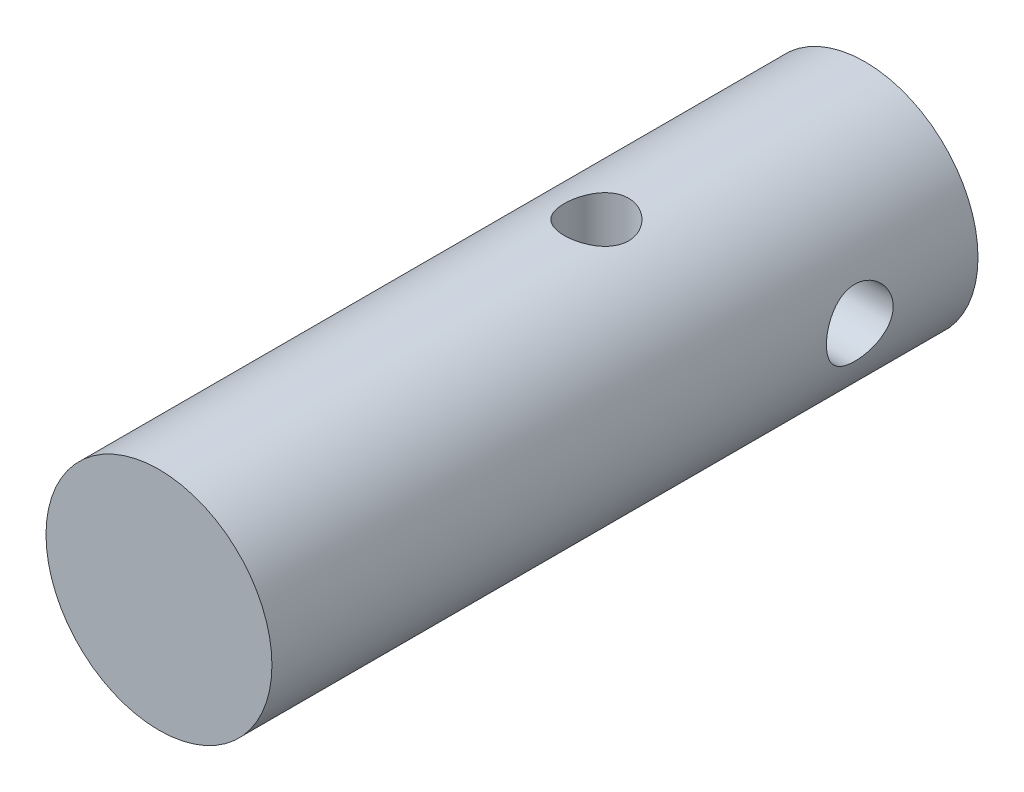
ISO-10303-21;
HEADER;
FILE_DESCRIPTION(('STEP AP214'),'2;1');
FILE_NAME('part.step','',(''),(''),'','','');
FILE_SCHEMA(('AUTOMOTIVE_DESIGN { 1 0 10303 214 1 1 1 1 }'));
ENDSEC;
DATA;
#1=APPLICATION_CONTEXT('core data for automotive mechanical design processes');
#2=APPLICATION_PROTOCOL_DEFINITION('international standard','automotive_design',2000,#1);
#3=PRODUCT_CONTEXT('',#1,'mechanical');
#4=PRODUCT('Part','Part','',(#3));
#5=PRODUCT_RELATED_PRODUCT_CATEGORY('part','',(#4));
#6=PRODUCT_DEFINITION_FORMATION('','',#4);
#7=PRODUCT_DEFINITION_CONTEXT('part definition',#1,'design');
#8=PRODUCT_DEFINITION('design','',#6,#7);
#9=PRODUCT_DEFINITION_SHAPE('','',#8);
#10=(LENGTH_UNIT() NAMED_UNIT(*) SI_UNIT(.MILLI.,.METRE.));
#11=(NAMED_UNIT(*) PLANE_ANGLE_UNIT() SI_UNIT($,.RADIAN.));
#12=(NAMED_UNIT(*) SI_UNIT($,.STERADIAN.) SOLID_ANGLE_UNIT());
#13=UNCERTAINTY_MEASURE_WITH_UNIT(LENGTH_MEASURE(1.E-05),#10,'distance_accuracy_value','');
#14=(GEOMETRIC_REPRESENTATION_CONTEXT(3) GLOBAL_UNCERTAINTY_ASSIGNED_CONTEXT((#13)) GLOBAL_UNIT_ASSIGNED_CONTEXT((#10,
#11,#12)) REPRESENTATION_CONTEXT('',''));
#15=CARTESIAN_POINT('',(0.,0.,0.));
#16=DIRECTION('',(0.,0.,1.));
#17=DIRECTION('',(1.,0.,0.));
#18=AXIS2_PLACEMENT_3D('',#15,#16,#17);
#19=CARTESIAN_POINT('',(0.,0.,-6.35));
#20=DIRECTION('',(0.,0.,1.));
#21=DIRECTION('',(1.,0.,0.));
#22=AXIS2_PLACEMENT_3D('',#19,#20,#21);
#23=CYLINDRICAL_SURFACE('',#22,5.08);
#24=CARTESIAN_POINT('',(5.08,0.,-2.53498163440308));
#25=CARTESIAN_POINT('',(5.07999919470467,0.0823481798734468,-2.5349804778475));
#26=CARTESIAN_POINT('',(5.07797844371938,0.164708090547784,-2.52817788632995));
#27=CARTESIAN_POINT('',(5.07011450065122,0.327033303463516,-2.50120938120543));
#28=CARTESIAN_POINT('',(5.06427006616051,0.406997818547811,-2.48103912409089));
#29=CARTESIAN_POINT('',(5.04939984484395,0.562167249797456,-2.42806469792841));
#30=CARTESIAN_POINT('',(5.04037866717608,0.637378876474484,-2.39527882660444));
#31=CARTESIAN_POINT('',(5.02009490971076,0.781237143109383,-2.31807782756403));
#32=CARTESIAN_POINT('',(5.00883205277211,0.849882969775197,-2.27366126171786));
#33=CARTESIAN_POINT('',(4.98491707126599,0.980576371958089,-2.17315344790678));
#34=CARTESIAN_POINT('',(4.97223715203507,1.04241484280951,-2.11679692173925));
#35=CARTESIAN_POINT('',(4.94708477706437,1.15591462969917,-1.9945745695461));
#36=CARTESIAN_POINT('',(4.93461235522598,1.20757429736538,-1.92870720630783));
#37=CARTESIAN_POINT('',(4.91099458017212,1.30033826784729,-1.78757855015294));
#38=CARTESIAN_POINT('',(4.8998838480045,1.34118953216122,-1.71214459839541));
#39=CARTESIAN_POINT('',(4.88066188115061,1.40954223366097,-1.55509673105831));
#40=CARTESIAN_POINT('',(4.87254995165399,1.43704676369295,-1.47348425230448));
#41=CARTESIAN_POINT('',(4.86053330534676,1.47717532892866,-1.30873956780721));
#42=CARTESIAN_POINT('',(4.85652010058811,1.49018395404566,-1.22570916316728));
#43=CARTESIAN_POINT('',(4.85283234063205,1.5021521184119,-1.05855490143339));
#44=CARTESIAN_POINT('',(4.8531567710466,1.5011149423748,-0.974431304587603));
#45=CARTESIAN_POINT('',(4.85801133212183,1.48532350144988,-0.810586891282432));
#46=CARTESIAN_POINT('',(4.86239449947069,1.47104853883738,-0.730814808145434));
#47=CARTESIAN_POINT('',(4.87463526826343,1.42996013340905,-0.57485225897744));
#48=CARTESIAN_POINT('',(4.88249320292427,1.4031454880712,-0.498662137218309));
#49=CARTESIAN_POINT('',(4.90091713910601,1.33738039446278,-0.350842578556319));
#50=CARTESIAN_POINT('',(4.9115179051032,1.29827265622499,-0.279287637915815));
#51=CARTESIAN_POINT('',(4.93421606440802,1.20914087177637,-0.143594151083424));
#52=CARTESIAN_POINT('',(4.94631381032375,1.15911425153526,-0.0794573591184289));
#53=CARTESIAN_POINT('',(4.97124119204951,1.04717388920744,0.0423008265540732));
#54=CARTESIAN_POINT('',(4.98408065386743,0.984861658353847,0.0995544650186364));
#55=CARTESIAN_POINT('',(5.00861106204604,0.851360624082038,0.202883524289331));
#56=CARTESIAN_POINT('',(5.02030194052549,0.780171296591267,0.248958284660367));
#57=CARTESIAN_POINT('',(5.04131910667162,0.630283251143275,0.3288356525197));
#58=CARTESIAN_POINT('',(5.05062999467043,0.55153994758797,0.362558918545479));
#59=CARTESIAN_POINT('',(5.0657271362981,0.389161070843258,0.416176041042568));
#60=CARTESIAN_POINT('',(5.07151434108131,0.305526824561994,0.436073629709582));
#61=CARTESIAN_POINT('',(5.07876258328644,0.138868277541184,0.460867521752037));
#62=CARTESIAN_POINT('',(5.08036736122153,0.0559242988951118,0.466262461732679));
#63=CARTESIAN_POINT('',(5.07949038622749,-0.109688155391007,0.463292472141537));
#64=CARTESIAN_POINT('',(5.07700916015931,-0.192356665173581,0.454929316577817));
#65=CARTESIAN_POINT('',(5.06833290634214,-0.353204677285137,0.425084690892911));
#66=CARTESIAN_POINT('',(5.06221986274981,-0.431442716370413,0.403892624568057));
#67=CARTESIAN_POINT('',(5.04698507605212,-0.583237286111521,0.349338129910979));
#68=CARTESIAN_POINT('',(5.03786297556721,-0.656793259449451,0.315974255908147));
#69=CARTESIAN_POINT('',(5.0173003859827,-0.79898576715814,0.237173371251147));
#70=CARTESIAN_POINT('',(5.0058120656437,-0.867473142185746,0.191480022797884));
#71=CARTESIAN_POINT('',(4.98183765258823,-0.995978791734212,0.0896302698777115));
#72=CARTESIAN_POINT('',(4.96935131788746,-1.05599500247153,0.0334713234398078));
#73=CARTESIAN_POINT('',(4.9442397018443,-1.16803678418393,-0.0900566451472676));
#74=CARTESIAN_POINT('',(4.93162492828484,-1.21970791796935,-0.157749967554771));
#75=CARTESIAN_POINT('',(4.90815255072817,-1.31097957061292,-0.301120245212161));
#76=CARTESIAN_POINT('',(4.89729489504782,-1.3505804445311,-0.376796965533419));
#77=CARTESIAN_POINT('',(4.87869198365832,-1.41630959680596,-0.533718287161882));
#78=CARTESIAN_POINT('',(4.87093152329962,-1.44250387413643,-0.61493333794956));
#79=CARTESIAN_POINT('',(4.859436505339,-1.48077134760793,-0.780891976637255));
#80=CARTESIAN_POINT('',(4.85570062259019,-1.49284919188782,-0.86563439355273));
#81=CARTESIAN_POINT('',(4.85280545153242,-1.50223177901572,-1.03256845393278));
#82=CARTESIAN_POINT('',(4.85346756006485,-1.50011301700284,-1.11472502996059));
#83=CARTESIAN_POINT('',(4.85886601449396,-1.4825328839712,-1.27745467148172));
#84=CARTESIAN_POINT('',(4.86360220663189,-1.46707201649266,-1.3580277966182));
#85=CARTESIAN_POINT('',(4.87649727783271,-1.42361341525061,-1.51439330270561));
#86=CARTESIAN_POINT('',(4.88461564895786,-1.39576380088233,-1.59023043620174));
#87=CARTESIAN_POINT('',(4.90335403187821,-1.32843324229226,-1.73621620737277));
#88=CARTESIAN_POINT('',(4.91397451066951,-1.28895012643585,-1.80636377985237));
#89=CARTESIAN_POINT('',(4.93698996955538,-1.19783515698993,-1.94166593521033));
#90=CARTESIAN_POINT('',(4.94943447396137,-1.14582256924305,-2.00655570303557));
#91=CARTESIAN_POINT('',(4.97445033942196,-1.03181610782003,-2.12687304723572));
#92=CARTESIAN_POINT('',(4.98702173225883,-0.969819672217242,-2.1822981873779));
#93=CARTESIAN_POINT('',(5.01129699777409,-0.835512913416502,-2.28365747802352));
#94=CARTESIAN_POINT('',(5.02296670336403,-0.762962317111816,-2.32928226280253));
#95=CARTESIAN_POINT('',(5.04371943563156,-0.61087544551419,-2.40762116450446));
#96=CARTESIAN_POINT('',(5.05280374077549,-0.531342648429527,-2.44034166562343));
#97=CARTESIAN_POINT('',(5.06651132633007,-0.377035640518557,-2.4888078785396));
#98=CARTESIAN_POINT('',(5.07152853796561,-0.302772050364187,-2.50607715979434));
#99=CARTESIAN_POINT('',(5.07827299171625,-0.152342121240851,-2.52916368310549));
#100=CARTESIAN_POINT('',(5.08000074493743,-0.0761760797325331,-2.53498270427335));
#101=CARTESIAN_POINT('',(5.08,0.,-2.53498163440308));
#102=B_SPLINE_CURVE_WITH_KNOTS('',3,(#24,#25,#26,#27,#28,#29,#30,#31,#32,#33,#34,#35,#36,#37,
#38,#39,#40,#41,#42,#43,#44,#45,#46,#47,#48,#49,#50,#51,#52,#53,#54,#55,#56,#57,#58,#59,#60,#61,
#62,#63,#64,#65,#66,#67,#68,#69,#70,#71,#72,#73,#74,#75,#76,#77,#78,#79,#80,#81,#82,#83,#84,#85,
#86,#87,#88,#89,#90,#91,#92,#93,#94,#95,#96,#97,#98,#99,#100,#101),.UNSPECIFIED.,.T.,.F.,(4,2,2,
2,2,2,2,2,2,2,2,2,2,2,2,2,2,2,2,2,2,2,2,2,2,2,2,2,2,2,2,2,2,2,2,2,2,2,4),(0.,0.246764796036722,
0.493609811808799,0.740098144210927,0.986616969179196,1.23932933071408,1.49208258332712,
1.75031388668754,2.00848532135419,2.25963083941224,2.51071762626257,2.75305400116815,
2.99541362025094,3.24100992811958,3.48666419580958,3.74223978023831,3.99783046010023,
4.25503530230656,4.51217068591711,4.76034475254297,5.00848682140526,5.25122951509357,
5.49400104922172,5.74227130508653,5.99060194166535,6.24764949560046,6.50468948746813,
6.76045162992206,7.01612953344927,7.26148963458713,7.50684047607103,7.74933361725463,
7.9918720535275,8.24300017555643,8.49419284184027,8.75242218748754,9.01052361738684,
9.23882855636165,9.46709801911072),.UNSPECIFIED.);
#103=CARTESIAN_POINT('',(5.08,0.,-2.53498163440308));
#104=VERTEX_POINT('',#103);
#105=EDGE_CURVE('E80',#104,#104,#102,.T.);
#106=ORIENTED_EDGE('',*,*,#105,.F.);
#107=EDGE_LOOP('',(#106));
#108=FACE_BOUND('',#107,.T.);
#109=CARTESIAN_POINT('',(-5.08,0.,-2.53498163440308));
#110=CARTESIAN_POINT('',(-5.07999919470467,-0.0823481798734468,-2.5349804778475));
#111=CARTESIAN_POINT('',(-5.07797844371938,-0.164708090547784,-2.52817788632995));
#112=CARTESIAN_POINT('',(-5.07011450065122,-0.327033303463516,-2.50120938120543));
#113=CARTESIAN_POINT('',(-5.06427006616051,-0.406997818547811,-2.48103912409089));
#114=CARTESIAN_POINT('',(-5.04939984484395,-0.562167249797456,-2.42806469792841));
#115=CARTESIAN_POINT('',(-5.04037866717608,-0.637378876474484,-2.39527882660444));
#116=CARTESIAN_POINT('',(-5.02009490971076,-0.781237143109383,-2.31807782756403));
#117=CARTESIAN_POINT('',(-5.00883205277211,-0.849882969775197,-2.27366126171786));
#118=CARTESIAN_POINT('',(-4.98491707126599,-0.980576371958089,-2.17315344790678));
#119=CARTESIAN_POINT('',(-4.97223715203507,-1.04241484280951,-2.11679692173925));
#120=CARTESIAN_POINT('',(-4.94708477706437,-1.15591462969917,-1.9945745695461));
#121=CARTESIAN_POINT('',(-4.93461235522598,-1.20757429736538,-1.92870720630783));
#122=CARTESIAN_POINT('',(-4.91099458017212,-1.30033826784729,-1.78757855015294));
#123=CARTESIAN_POINT('',(-4.8998838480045,-1.34118953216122,-1.71214459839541));
#124=CARTESIAN_POINT('',(-4.88066188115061,-1.40954223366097,-1.55509673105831));
#125=CARTESIAN_POINT('',(-4.87254995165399,-1.43704676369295,-1.47348425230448));
#126=CARTESIAN_POINT('',(-4.86053330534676,-1.47717532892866,-1.30873956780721));
#127=CARTESIAN_POINT('',(-4.85652010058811,-1.49018395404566,-1.22570916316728));
#128=CARTESIAN_POINT('',(-4.85283234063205,-1.5021521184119,-1.05855490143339));
#129=CARTESIAN_POINT('',(-4.8531567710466,-1.5011149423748,-0.974431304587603));
#130=CARTESIAN_POINT('',(-4.85801133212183,-1.48532350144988,-0.810586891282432));
#131=CARTESIAN_POINT('',(-4.86239449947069,-1.47104853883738,-0.730814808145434));
#132=CARTESIAN_POINT('',(-4.87463526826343,-1.42996013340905,-0.57485225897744));
#133=CARTESIAN_POINT('',(-4.88249320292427,-1.4031454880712,-0.498662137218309));
#134=CARTESIAN_POINT('',(-4.90091713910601,-1.33738039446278,-0.350842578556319));
#135=CARTESIAN_POINT('',(-4.9115179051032,-1.29827265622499,-0.279287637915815));
#136=CARTESIAN_POINT('',(-4.93421606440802,-1.20914087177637,-0.143594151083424));
#137=CARTESIAN_POINT('',(-4.94631381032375,-1.15911425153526,-0.0794573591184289));
#138=CARTESIAN_POINT('',(-4.97124119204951,-1.04717388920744,0.0423008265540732));
#139=CARTESIAN_POINT('',(-4.98408065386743,-0.984861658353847,0.0995544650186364));
#140=CARTESIAN_POINT('',(-5.00861106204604,-0.851360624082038,0.202883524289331));
#141=CARTESIAN_POINT('',(-5.02030194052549,-0.780171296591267,0.248958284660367));
#142=CARTESIAN_POINT('',(-5.04131910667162,-0.630283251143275,0.3288356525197));
#143=CARTESIAN_POINT('',(-5.05062999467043,-0.55153994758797,0.362558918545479));
#144=CARTESIAN_POINT('',(-5.0657271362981,-0.389161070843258,0.416176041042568));
#145=CARTESIAN_POINT('',(-5.07151434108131,-0.305526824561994,0.436073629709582));
#146=CARTESIAN_POINT('',(-5.07876258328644,-0.138868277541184,0.460867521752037));
#147=CARTESIAN_POINT('',(-5.08036736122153,-0.0559242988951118,0.466262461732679));
#148=CARTESIAN_POINT('',(-5.07949038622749,0.109688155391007,0.463292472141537));
#149=CARTESIAN_POINT('',(-5.07700916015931,0.192356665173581,0.454929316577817));
#150=CARTESIAN_POINT('',(-5.06833290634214,0.353204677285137,0.425084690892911));
#151=CARTESIAN_POINT('',(-5.06221986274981,0.431442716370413,0.403892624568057));
#152=CARTESIAN_POINT('',(-5.04698507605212,0.583237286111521,0.349338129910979));
#153=CARTESIAN_POINT('',(-5.03786297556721,0.656793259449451,0.315974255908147));
#154=CARTESIAN_POINT('',(-5.0173003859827,0.79898576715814,0.237173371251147));
#155=CARTESIAN_POINT('',(-5.0058120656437,0.867473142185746,0.191480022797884));
#156=CARTESIAN_POINT('',(-4.98183765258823,0.995978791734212,0.0896302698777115));
#157=CARTESIAN_POINT('',(-4.96935131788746,1.05599500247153,0.0334713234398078));
#158=CARTESIAN_POINT('',(-4.9442397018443,1.16803678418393,-0.0900566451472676));
#159=CARTESIAN_POINT('',(-4.93162492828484,1.21970791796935,-0.157749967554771));
#160=CARTESIAN_POINT('',(-4.90815255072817,1.31097957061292,-0.301120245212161));
#161=CARTESIAN_POINT('',(-4.89729489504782,1.3505804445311,-0.376796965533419));
#162=CARTESIAN_POINT('',(-4.87869198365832,1.41630959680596,-0.533718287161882));
#163=CARTESIAN_POINT('',(-4.87093152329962,1.44250387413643,-0.61493333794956));
#164=CARTESIAN_POINT('',(-4.859436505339,1.48077134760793,-0.780891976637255));
#165=CARTESIAN_POINT('',(-4.85570062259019,1.49284919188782,-0.86563439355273));
#166=CARTESIAN_POINT('',(-4.85280545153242,1.50223177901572,-1.03256845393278));
#167=CARTESIAN_POINT('',(-4.85346756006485,1.50011301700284,-1.11472502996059));
#168=CARTESIAN_POINT('',(-4.85886601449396,1.4825328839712,-1.27745467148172));
#169=CARTESIAN_POINT('',(-4.86360220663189,1.46707201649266,-1.3580277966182));
#170=CARTESIAN_POINT('',(-4.87649727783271,1.42361341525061,-1.51439330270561));
#171=CARTESIAN_POINT('',(-4.88461564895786,1.39576380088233,-1.59023043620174));
#172=CARTESIAN_POINT('',(-4.90335403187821,1.32843324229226,-1.73621620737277));
#173=CARTESIAN_POINT('',(-4.91397451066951,1.28895012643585,-1.80636377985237));
#174=CARTESIAN_POINT('',(-4.93698996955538,1.19783515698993,-1.94166593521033));
#175=CARTESIAN_POINT('',(-4.94943447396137,1.14582256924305,-2.00655570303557));
#176=CARTESIAN_POINT('',(-4.97445033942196,1.03181610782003,-2.12687304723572));
#177=CARTESIAN_POINT('',(-4.98702173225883,0.969819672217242,-2.1822981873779));
#178=CARTESIAN_POINT('',(-5.01129699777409,0.835512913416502,-2.28365747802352));
#179=CARTESIAN_POINT('',(-5.02296670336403,0.762962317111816,-2.32928226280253));
#180=CARTESIAN_POINT('',(-5.04371943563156,0.61087544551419,-2.40762116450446));
#181=CARTESIAN_POINT('',(-5.05280374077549,0.531342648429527,-2.44034166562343));
#182=CARTESIAN_POINT('',(-5.06651132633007,0.377035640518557,-2.4888078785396));
#183=CARTESIAN_POINT('',(-5.07152853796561,0.302772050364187,-2.50607715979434));
#184=CARTESIAN_POINT('',(-5.07827299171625,0.152342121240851,-2.52916368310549));
#185=CARTESIAN_POINT('',(-5.08000074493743,0.0761760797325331,-2.53498270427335));
#186=CARTESIAN_POINT('',(-5.08,0.,-2.53498163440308));
#187=B_SPLINE_CURVE_WITH_KNOTS('',3,(#109,#110,#111,#112,#113,#114,#115,#116,#117,#118,#119,
#120,#121,#122,#123,#124,#125,#126,#127,#128,#129,#130,#131,#132,#133,#134,#135,#136,#137,#138,
#139,#140,#141,#142,#143,#144,#145,#146,#147,#148,#149,#150,#151,#152,#153,#154,#155,#156,#157,
#158,#159,#160,#161,#162,#163,#164,#165,#166,#167,#168,#169,#170,#171,#172,#173,#174,#175,#176,
#177,#178,#179,#180,#181,#182,#183,#184,#185,#186),.UNSPECIFIED.,.T.,.F.,(4,2,2,2,2,2,2,2,2,2,2,
2,2,2,2,2,2,2,2,2,2,2,2,2,2,2,2,2,2,2,2,2,2,2,2,2,2,2,4),(0.,0.246764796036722,
0.493609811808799,0.740098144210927,0.986616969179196,1.23932933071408,1.49208258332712,
1.75031388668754,2.00848532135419,2.25963083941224,2.51071762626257,2.75305400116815,
2.99541362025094,3.24100992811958,3.48666419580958,3.74223978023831,3.99783046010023,
4.25503530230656,4.51217068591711,4.76034475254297,5.00848682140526,5.25122951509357,
5.49400104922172,5.74227130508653,5.99060194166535,6.24764949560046,6.50468948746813,
6.76045162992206,7.01612953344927,7.26148963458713,7.50684047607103,7.74933361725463,
7.9918720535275,8.24300017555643,8.49419284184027,8.75242218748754,9.01052361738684,
9.23882855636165,9.46709801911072),.UNSPECIFIED.);
#188=CARTESIAN_POINT('',(-5.08,0.,-2.53498163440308));
#189=VERTEX_POINT('',#188);
#190=EDGE_CURVE('E54',#189,#189,#187,.T.);
#191=ORIENTED_EDGE('',*,*,#190,.F.);
#192=EDGE_LOOP('',(#191));
#193=FACE_BOUND('',#192,.T.);
#194=CARTESIAN_POINT('',(0.,-5.08,7.18003673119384));
#195=CARTESIAN_POINT('',(-0.0797206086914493,-5.07999904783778,7.18003531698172));
#196=CARTESIAN_POINT('',(-0.159455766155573,-5.07810523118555,7.17344028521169));
#197=CARTESIAN_POINT('',(-0.316615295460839,-5.07073491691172,7.14728980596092));
#198=CARTESIAN_POINT('',(-0.394038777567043,-5.06525705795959,7.1277294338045));
#199=CARTESIAN_POINT('',(-0.54428473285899,-5.05132087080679,7.07634639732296));
#200=CARTESIAN_POINT('',(-0.617113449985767,-5.04286669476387,7.04454081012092));
#201=CARTESIAN_POINT('',(-0.756403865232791,-5.02386317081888,6.9696372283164));
#202=CARTESIAN_POINT('',(-0.822864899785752,-5.01331360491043,6.92653805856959));
#203=CARTESIAN_POINT('',(-0.949277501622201,-4.99094117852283,6.82907777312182));
#204=CARTESIAN_POINT('',(-1.00903824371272,-4.97909412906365,6.77447470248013));
#205=CARTESIAN_POINT('',(-1.11869094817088,-4.95561112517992,6.65607293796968));
#206=CARTESIAN_POINT('',(-1.16858143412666,-4.94397520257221,6.5922728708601));
#207=CARTESIAN_POINT('',(-1.25804806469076,-4.92197991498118,6.45571488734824));
#208=CARTESIAN_POINT('',(-1.29739735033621,-4.91165082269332,6.38280301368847));
#209=CARTESIAN_POINT('',(-1.36320052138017,-4.89379761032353,6.23105507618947));
#210=CARTESIAN_POINT('',(-1.38965717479,-4.886272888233,6.15222028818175));
#211=CARTESIAN_POINT('',(-1.42824736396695,-4.87513142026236,5.99299443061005));
#212=CARTESIAN_POINT('',(-1.44073014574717,-4.87141958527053,5.91269482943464));
#213=CARTESIAN_POINT('',(-1.45210809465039,-4.86804071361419,5.75106200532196));
#214=CARTESIAN_POINT('',(-1.45100620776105,-4.86837279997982,5.66972901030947));
#215=CARTESIAN_POINT('',(-1.43552173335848,-4.87295959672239,5.51112570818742));
#216=CARTESIAN_POINT('',(-1.42156980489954,-4.87708709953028,5.43380907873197));
#217=CARTESIAN_POINT('',(-1.38147436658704,-4.88859482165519,5.2826627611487));
#218=CARTESIAN_POINT('',(-1.35532975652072,-4.89597533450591,5.20883338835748));
#219=CARTESIAN_POINT('',(-1.29125891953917,-4.91326359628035,5.06567295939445));
#220=CARTESIAN_POINT('',(-1.25318797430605,-4.92320210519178,4.99641054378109));
#221=CARTESIAN_POINT('',(-1.16644588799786,-4.94447097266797,4.86510983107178));
#222=CARTESIAN_POINT('',(-1.11777239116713,-4.95580164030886,4.80307314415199));
#223=CARTESIAN_POINT('',(-1.00903951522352,-4.97910021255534,4.68553392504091));
#224=CARTESIAN_POINT('',(-0.948620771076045,-4.99107605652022,4.63036488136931));
#225=CARTESIAN_POINT('',(-0.819240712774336,-5.0139359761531,4.53086848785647));
#226=CARTESIAN_POINT('',(-0.750278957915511,-5.02481999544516,4.48654169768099));
#227=CARTESIAN_POINT('',(-0.605204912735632,-5.0443539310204,4.40981109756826));
#228=CARTESIAN_POINT('',(-0.529054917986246,-5.05299105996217,4.37747510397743));
#229=CARTESIAN_POINT('',(-0.372095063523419,-5.06696589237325,4.32616430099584));
#230=CARTESIAN_POINT('',(-0.291286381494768,-5.07230442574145,4.30718613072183));
#231=CARTESIAN_POINT('',(-0.130142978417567,-5.07895187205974,4.28367061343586));
#232=CARTESIAN_POINT('',(-0.0498794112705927,-5.08038703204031,4.27868067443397));
#233=CARTESIAN_POINT('',(0.11034047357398,-5.0794330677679,4.28202312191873));
#234=CARTESIAN_POINT('',(0.190296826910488,-5.07704440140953,4.29035391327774));
#235=CARTESIAN_POINT('',(0.34596621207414,-5.06879337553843,4.31973280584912));
#236=CARTESIAN_POINT('',(0.421732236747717,-5.06300182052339,4.34052185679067));
#237=CARTESIAN_POINT('',(0.568689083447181,-5.04860861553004,4.39392037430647));
#238=CARTESIAN_POINT('',(0.639879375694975,-5.0400066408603,4.42653120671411));
#239=CARTESIAN_POINT('',(0.777371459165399,-5.02065946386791,4.50344286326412));
#240=CARTESIAN_POINT('',(0.843534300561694,-5.00987194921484,4.54798116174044));
#241=CARTESIAN_POINT('',(0.967603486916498,-4.98739667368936,4.64719055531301));
#242=CARTESIAN_POINT('',(1.02550795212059,-4.97570870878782,4.70186395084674));
#243=CARTESIAN_POINT('',(1.13337192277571,-4.95227402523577,4.82191297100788));
#244=CARTESIAN_POINT('',(1.18301041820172,-4.94053784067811,4.8875796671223));
#245=CARTESIAN_POINT('',(1.27057891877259,-4.91874709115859,5.02656385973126));
#246=CARTESIAN_POINT('',(1.30850933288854,-4.90869246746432,5.09988108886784));
#247=CARTESIAN_POINT('',(1.37130819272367,-4.89152069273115,5.25177988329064));
#248=CARTESIAN_POINT('',(1.39624599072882,-4.88438798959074,5.3303309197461));
#249=CARTESIAN_POINT('',(1.4324806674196,-4.87388570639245,5.49075467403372));
#250=CARTESIAN_POINT('',(1.44378166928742,-4.87051498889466,5.57262638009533));
#251=CARTESIAN_POINT('',(1.45216038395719,-4.86802287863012,5.73405510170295));
#252=CARTESIAN_POINT('',(1.4497579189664,-4.86874617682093,5.81358311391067));
#253=CARTESIAN_POINT('',(1.43202296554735,-4.87399157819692,5.97104994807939));
#254=CARTESIAN_POINT('',(1.41669090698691,-4.87851355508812,6.04898882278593));
#255=CARTESIAN_POINT('',(1.37385277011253,-4.89074773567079,6.20030360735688));
#256=CARTESIAN_POINT('',(1.34647194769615,-4.89842706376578,6.27371782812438));
#257=CARTESIAN_POINT('',(1.2804104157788,-4.91610751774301,6.41496828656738));
#258=CARTESIAN_POINT('',(1.24172770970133,-4.92610905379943,6.48280353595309));
#259=CARTESIAN_POINT('',(1.15264882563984,-4.94772317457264,6.61341408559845));
#260=CARTESIAN_POINT('',(1.10190524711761,-4.95937834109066,6.67594541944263));
#261=CARTESIAN_POINT('',(0.990786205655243,-4.98276642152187,6.79177404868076));
#262=CARTESIAN_POINT('',(0.930408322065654,-4.99449935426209,6.84506901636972));
#263=CARTESIAN_POINT('',(0.799872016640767,-5.01708056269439,6.94226337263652));
#264=CARTESIAN_POINT('',(0.729502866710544,-5.02789852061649,6.98588746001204));
#265=CARTESIAN_POINT('',(0.582120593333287,-5.04708256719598,7.06062059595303));
#266=CARTESIAN_POINT('',(0.505111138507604,-5.05544999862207,7.09173650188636));
#267=CARTESIAN_POINT('',(0.357159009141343,-5.06789918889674,7.13720121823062));
#268=CARTESIAN_POINT('',(0.286761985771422,-5.07240153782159,7.15322390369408));
#269=CARTESIAN_POINT('',(0.14424712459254,-5.07845217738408,7.174641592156));
#270=CARTESIAN_POINT('',(0.0721295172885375,-5.0800008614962,7.180038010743));
#271=CARTESIAN_POINT('',(0.,-5.08,7.18003673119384));
#272=B_SPLINE_CURVE_WITH_KNOTS('',3,(#194,#195,#196,#197,#198,#199,#200,#201,#202,#203,#204,
#205,#206,#207,#208,#209,#210,#211,#212,#213,#214,#215,#216,#217,#218,#219,#220,#221,#222,#223,
#224,#225,#226,#227,#228,#229,#230,#231,#232,#233,#234,#235,#236,#237,#238,#239,#240,#241,#242,
#243,#244,#245,#246,#247,#248,#249,#250,#251,#252,#253,#254,#255,#256,#257,#258,#259,#260,#261,
#262,#263,#264,#265,#266,#267,#268,#269,#270,#271),.UNSPECIFIED.,.T.,.F.,(4,2,2,2,2,2,2,2,2,2,2,
2,2,2,2,2,2,2,2,2,2,2,2,2,2,2,2,2,2,2,2,2,2,2,2,2,2,2,4),(0.,0.238897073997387,
0.477884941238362,0.716540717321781,0.95522133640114,1.19953941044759,1.44389400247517,
1.69314791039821,1.94234828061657,2.18517079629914,2.42794065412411,2.66285917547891,
2.89779889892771,3.13570774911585,3.37366951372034,3.62058075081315,3.86750473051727,
4.11580467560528,4.36404212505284,4.60414960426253,4.84422833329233,5.07948025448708,
5.31475936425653,5.55512474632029,5.79554475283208,6.0438120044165,6.29207058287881,
6.53899006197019,6.78583486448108,7.02337977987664,7.26091679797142,7.49604072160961,
7.73120620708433,7.97420879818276,8.21727254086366,8.46655564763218,8.71570190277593,
8.93187971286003,9.14802872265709),.UNSPECIFIED.);
#273=CARTESIAN_POINT('',(0.,-5.08,7.18003673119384));
#274=VERTEX_POINT('',#273);
#275=EDGE_CURVE('E58',#274,#274,#272,.T.);
#276=ORIENTED_EDGE('',*,*,#275,.F.);
#277=EDGE_LOOP('',(#276));
#278=FACE_BOUND('',#277,.T.);
#279=CARTESIAN_POINT('',(0.,5.08,7.18003673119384));
#280=CARTESIAN_POINT('',(0.0797206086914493,5.07999904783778,7.18003531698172));
#281=CARTESIAN_POINT('',(0.159455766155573,5.07810523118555,7.17344028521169));
#282=CARTESIAN_POINT('',(0.316615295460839,5.07073491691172,7.14728980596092));
#283=CARTESIAN_POINT('',(0.394038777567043,5.06525705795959,7.1277294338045));
#284=CARTESIAN_POINT('',(0.54428473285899,5.05132087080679,7.07634639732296));
#285=CARTESIAN_POINT('',(0.617113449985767,5.04286669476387,7.04454081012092));
#286=CARTESIAN_POINT('',(0.756403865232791,5.02386317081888,6.9696372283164));
#287=CARTESIAN_POINT('',(0.822864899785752,5.01331360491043,6.92653805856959));
#288=CARTESIAN_POINT('',(0.949277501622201,4.99094117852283,6.82907777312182));
#289=CARTESIAN_POINT('',(1.00903824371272,4.97909412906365,6.77447470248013));
#290=CARTESIAN_POINT('',(1.11869094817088,4.95561112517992,6.65607293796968));
#291=CARTESIAN_POINT('',(1.16858143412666,4.94397520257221,6.5922728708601));
#292=CARTESIAN_POINT('',(1.25804806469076,4.92197991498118,6.45571488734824));
#293=CARTESIAN_POINT('',(1.29739735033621,4.91165082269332,6.38280301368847));
#294=CARTESIAN_POINT('',(1.36320052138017,4.89379761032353,6.23105507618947));
#295=CARTESIAN_POINT('',(1.38965717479,4.886272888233,6.15222028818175));
#296=CARTESIAN_POINT('',(1.42824736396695,4.87513142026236,5.99299443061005));
#297=CARTESIAN_POINT('',(1.44073014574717,4.87141958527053,5.91269482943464));
#298=CARTESIAN_POINT('',(1.45210809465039,4.86804071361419,5.75106200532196));
#299=CARTESIAN_POINT('',(1.45100620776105,4.86837279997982,5.66972901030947));
#300=CARTESIAN_POINT('',(1.43552173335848,4.87295959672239,5.51112570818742));
#301=CARTESIAN_POINT('',(1.42156980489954,4.87708709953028,5.43380907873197));
#302=CARTESIAN_POINT('',(1.38147436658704,4.88859482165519,5.2826627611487));
#303=CARTESIAN_POINT('',(1.35532975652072,4.89597533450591,5.20883338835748));
#304=CARTESIAN_POINT('',(1.29125891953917,4.91326359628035,5.06567295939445));
#305=CARTESIAN_POINT('',(1.25318797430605,4.92320210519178,4.99641054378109));
#306=CARTESIAN_POINT('',(1.16644588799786,4.94447097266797,4.86510983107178));
#307=CARTESIAN_POINT('',(1.11777239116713,4.95580164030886,4.80307314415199));
#308=CARTESIAN_POINT('',(1.00903951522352,4.97910021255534,4.68553392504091));
#309=CARTESIAN_POINT('',(0.948620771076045,4.99107605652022,4.63036488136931));
#310=CARTESIAN_POINT('',(0.819240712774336,5.0139359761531,4.53086848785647));
#311=CARTESIAN_POINT('',(0.750278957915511,5.02481999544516,4.48654169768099));
#312=CARTESIAN_POINT('',(0.605204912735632,5.0443539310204,4.40981109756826));
#313=CARTESIAN_POINT('',(0.529054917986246,5.05299105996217,4.37747510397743));
#314=CARTESIAN_POINT('',(0.372095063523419,5.06696589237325,4.32616430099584));
#315=CARTESIAN_POINT('',(0.291286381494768,5.07230442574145,4.30718613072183));
#316=CARTESIAN_POINT('',(0.130142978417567,5.07895187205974,4.28367061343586));
#317=CARTESIAN_POINT('',(0.0498794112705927,5.08038703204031,4.27868067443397));
#318=CARTESIAN_POINT('',(-0.11034047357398,5.0794330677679,4.28202312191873));
#319=CARTESIAN_POINT('',(-0.190296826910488,5.07704440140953,4.29035391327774));
#320=CARTESIAN_POINT('',(-0.34596621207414,5.06879337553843,4.31973280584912));
#321=CARTESIAN_POINT('',(-0.421732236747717,5.06300182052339,4.34052185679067));
#322=CARTESIAN_POINT('',(-0.568689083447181,5.04860861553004,4.39392037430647));
#323=CARTESIAN_POINT('',(-0.639879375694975,5.0400066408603,4.42653120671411));
#324=CARTESIAN_POINT('',(-0.777371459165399,5.02065946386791,4.50344286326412));
#325=CARTESIAN_POINT('',(-0.843534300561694,5.00987194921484,4.54798116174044));
#326=CARTESIAN_POINT('',(-0.967603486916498,4.98739667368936,4.64719055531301));
#327=CARTESIAN_POINT('',(-1.02550795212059,4.97570870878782,4.70186395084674));
#328=CARTESIAN_POINT('',(-1.13337192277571,4.95227402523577,4.82191297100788));
#329=CARTESIAN_POINT('',(-1.18301041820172,4.94053784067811,4.8875796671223));
#330=CARTESIAN_POINT('',(-1.27057891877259,4.91874709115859,5.02656385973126));
#331=CARTESIAN_POINT('',(-1.30850933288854,4.90869246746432,5.09988108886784));
#332=CARTESIAN_POINT('',(-1.37130819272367,4.89152069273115,5.25177988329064));
#333=CARTESIAN_POINT('',(-1.39624599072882,4.88438798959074,5.3303309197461));
#334=CARTESIAN_POINT('',(-1.4324806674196,4.87388570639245,5.49075467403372));
#335=CARTESIAN_POINT('',(-1.44378166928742,4.87051498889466,5.57262638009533));
#336=CARTESIAN_POINT('',(-1.45216038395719,4.86802287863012,5.73405510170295));
#337=CARTESIAN_POINT('',(-1.4497579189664,4.86874617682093,5.81358311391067));
#338=CARTESIAN_POINT('',(-1.43202296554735,4.87399157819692,5.97104994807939));
#339=CARTESIAN_POINT('',(-1.41669090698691,4.87851355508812,6.04898882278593));
#340=CARTESIAN_POINT('',(-1.37385277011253,4.89074773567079,6.20030360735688));
#341=CARTESIAN_POINT('',(-1.34647194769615,4.89842706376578,6.27371782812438));
#342=CARTESIAN_POINT('',(-1.2804104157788,4.91610751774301,6.41496828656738));
#343=CARTESIAN_POINT('',(-1.24172770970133,4.92610905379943,6.48280353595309));
#344=CARTESIAN_POINT('',(-1.15264882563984,4.94772317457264,6.61341408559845));
#345=CARTESIAN_POINT('',(-1.10190524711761,4.95937834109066,6.67594541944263));
#346=CARTESIAN_POINT('',(-0.990786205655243,4.98276642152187,6.79177404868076));
#347=CARTESIAN_POINT('',(-0.930408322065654,4.99449935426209,6.84506901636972));
#348=CARTESIAN_POINT('',(-0.799872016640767,5.01708056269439,6.94226337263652));
#349=CARTESIAN_POINT('',(-0.729502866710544,5.02789852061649,6.98588746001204));
#350=CARTESIAN_POINT('',(-0.582120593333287,5.04708256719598,7.06062059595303));
#351=CARTESIAN_POINT('',(-0.505111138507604,5.05544999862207,7.09173650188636));
#352=CARTESIAN_POINT('',(-0.357159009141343,5.06789918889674,7.13720121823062));
#353=CARTESIAN_POINT('',(-0.286761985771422,5.07240153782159,7.15322390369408));
#354=CARTESIAN_POINT('',(-0.14424712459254,5.07845217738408,7.174641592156));
#355=CARTESIAN_POINT('',(-0.0721295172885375,5.0800008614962,7.180038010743));
#356=CARTESIAN_POINT('',(0.,5.08,7.18003673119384));
#357=B_SPLINE_CURVE_WITH_KNOTS('',3,(#279,#280,#281,#282,#283,#284,#285,#286,#287,#288,#289,
#290,#291,#292,#293,#294,#295,#296,#297,#298,#299,#300,#301,#302,#303,#304,#305,#306,#307,#308,
#309,#310,#311,#312,#313,#314,#315,#316,#317,#318,#319,#320,#321,#322,#323,#324,#325,#326,#327,
#328,#329,#330,#331,#332,#333,#334,#335,#336,#337,#338,#339,#340,#341,#342,#343,#344,#345,#346,
#347,#348,#349,#350,#351,#352,#353,#354,#355,#356),.UNSPECIFIED.,.T.,.F.,(4,2,2,2,2,2,2,2,2,2,2,
2,2,2,2,2,2,2,2,2,2,2,2,2,2,2,2,2,2,2,2,2,2,2,2,2,2,2,4),(0.,0.238897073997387,
0.477884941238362,0.716540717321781,0.95522133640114,1.19953941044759,1.44389400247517,
1.69314791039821,1.94234828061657,2.18517079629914,2.42794065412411,2.66285917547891,
2.89779889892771,3.13570774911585,3.37366951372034,3.62058075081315,3.86750473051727,
4.11580467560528,4.36404212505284,4.60414960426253,4.84422833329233,5.07948025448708,
5.31475936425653,5.55512474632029,5.79554475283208,6.0438120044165,6.29207058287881,
6.53899006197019,6.78583486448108,7.02337977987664,7.26091679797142,7.49604072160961,
7.73120620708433,7.97420879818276,8.21727254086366,8.46655564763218,8.71570190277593,
8.93187971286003,9.14802872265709),.UNSPECIFIED.);
#358=CARTESIAN_POINT('',(0.,5.08,7.18003673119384));
#359=VERTEX_POINT('',#358);
#360=EDGE_CURVE('E69',#359,#359,#357,.T.);
#361=ORIENTED_EDGE('',*,*,#360,.F.);
#362=EDGE_LOOP('',(#361));
#363=FACE_BOUND('',#362,.T.);
#364=CARTESIAN_POINT('',(0.,0.,-6.35));
#365=DIRECTION('',(0.,0.,1.));
#366=DIRECTION('',(1.,0.,0.));
#367=AXIS2_PLACEMENT_3D('',#364,#365,#366);
#368=CIRCLE('',#367,5.08);
#369=CARTESIAN_POINT('',(5.08,0.,-6.35));
#370=VERTEX_POINT('',#369);
#371=EDGE_CURVE('E103',#370,#370,#368,.T.);
#372=ORIENTED_EDGE('',*,*,#371,.T.);
#373=EDGE_LOOP('',(#372));
#374=FACE_BOUND('',#373,.T.);
#375=CARTESIAN_POINT('',(0.,0.,25.4));
#376=DIRECTION('',(0.,0.,1.));
#377=DIRECTION('',(1.,0.,0.));
#378=AXIS2_PLACEMENT_3D('',#375,#376,#377);
#379=CIRCLE('',#378,5.08);
#380=CARTESIAN_POINT('',(5.08,0.,25.4));
#381=VERTEX_POINT('',#380);
#382=EDGE_CURVE('E102',#381,#381,#379,.T.);
#383=ORIENTED_EDGE('',*,*,#382,.F.);
#384=EDGE_LOOP('',(#383));
#385=FACE_BOUND('',#384,.T.);
#386=CARTESIAN_POINT('',(-5.08,0.,24.36));
#387=CARTESIAN_POINT('',(-5.07999919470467,-0.0823481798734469,24.3599988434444));
#388=CARTESIAN_POINT('',(-5.07797844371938,-0.164708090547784,24.3531962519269));
#389=CARTESIAN_POINT('',(-5.07011450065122,-0.327033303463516,24.3262277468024));
#390=CARTESIAN_POINT('',(-5.06427006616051,-0.406997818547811,24.3060574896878));
#391=CARTESIAN_POINT('',(-5.04939984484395,-0.562167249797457,24.2530830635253));
#392=CARTESIAN_POINT('',(-5.04037866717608,-0.637378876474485,24.2202971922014));
#393=CARTESIAN_POINT('',(-5.02009490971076,-0.781237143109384,24.143096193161));
#394=CARTESIAN_POINT('',(-5.00883205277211,-0.849882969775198,24.0986796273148));
#395=CARTESIAN_POINT('',(-4.98491707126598,-0.980576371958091,23.9981718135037));
#396=CARTESIAN_POINT('',(-4.97223715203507,-1.04241484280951,23.9418152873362));
#397=CARTESIAN_POINT('',(-4.94708477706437,-1.15591462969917,23.819592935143));
#398=CARTESIAN_POINT('',(-4.93461235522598,-1.20757429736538,23.7537255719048));
#399=CARTESIAN_POINT('',(-4.91099458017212,-1.30033826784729,23.6125969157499));
#400=CARTESIAN_POINT('',(-4.8998838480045,-1.34118953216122,23.5371629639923));
#401=CARTESIAN_POINT('',(-4.88066188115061,-1.40954223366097,23.3801150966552));
#402=CARTESIAN_POINT('',(-4.87254995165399,-1.43704676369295,23.2985026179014));
#403=CARTESIAN_POINT('',(-4.86053330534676,-1.47717532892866,23.1337579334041));
#404=CARTESIAN_POINT('',(-4.85652010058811,-1.49018395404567,23.0507275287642));
#405=CARTESIAN_POINT('',(-4.85283234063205,-1.50215211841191,22.8835732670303));
#406=CARTESIAN_POINT('',(-4.8531567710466,-1.5011149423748,22.7994496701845));
#407=CARTESIAN_POINT('',(-4.85801133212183,-1.48532350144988,22.6356052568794));
#408=CARTESIAN_POINT('',(-4.86239449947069,-1.47104853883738,22.5558331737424));
#409=CARTESIAN_POINT('',(-4.87463526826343,-1.42996013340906,22.3998706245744));
#410=CARTESIAN_POINT('',(-4.88249320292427,-1.40314548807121,22.3236805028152));
#411=CARTESIAN_POINT('',(-4.90091713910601,-1.33738039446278,22.1758609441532));
#412=CARTESIAN_POINT('',(-4.9115179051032,-1.298272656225,22.1043060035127));
#413=CARTESIAN_POINT('',(-4.93421606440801,-1.20914087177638,21.9686125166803));
#414=CARTESIAN_POINT('',(-4.94631381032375,-1.15911425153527,21.9044757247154));
#415=CARTESIAN_POINT('',(-4.97124119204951,-1.04717388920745,21.7827175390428));
#416=CARTESIAN_POINT('',(-4.98408065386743,-0.984861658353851,21.7254639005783));
#417=CARTESIAN_POINT('',(-5.00861106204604,-0.851360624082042,21.6221348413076));
#418=CARTESIAN_POINT('',(-5.02030194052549,-0.780171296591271,21.5760600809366));
#419=CARTESIAN_POINT('',(-5.04131910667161,-0.630283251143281,21.4961827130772));
#420=CARTESIAN_POINT('',(-5.05062999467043,-0.551539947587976,21.4624594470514));
#421=CARTESIAN_POINT('',(-5.0657271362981,-0.389161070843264,21.4088423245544));
#422=CARTESIAN_POINT('',(-5.07151434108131,-0.305526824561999,21.3889447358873));
#423=CARTESIAN_POINT('',(-5.07876258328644,-0.138868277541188,21.3641508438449));
#424=CARTESIAN_POINT('',(-5.08036736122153,-0.0559242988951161,21.3587559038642));
#425=CARTESIAN_POINT('',(-5.07949038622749,0.109688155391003,21.3617258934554));
#426=CARTESIAN_POINT('',(-5.07700916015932,0.192356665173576,21.3700890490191));
#427=CARTESIAN_POINT('',(-5.06833290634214,0.353204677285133,21.399933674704));
#428=CARTESIAN_POINT('',(-5.06221986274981,0.431442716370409,21.4211257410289));
#429=CARTESIAN_POINT('',(-5.04698507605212,0.583237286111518,21.4756802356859));
#430=CARTESIAN_POINT('',(-5.03786297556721,0.656793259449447,21.5090441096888));
#431=CARTESIAN_POINT('',(-5.0173003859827,0.798985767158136,21.5878449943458));
#432=CARTESIAN_POINT('',(-5.0058120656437,0.867473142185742,21.633538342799));
#433=CARTESIAN_POINT('',(-4.98183765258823,0.995978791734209,21.7353880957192));
#434=CARTESIAN_POINT('',(-4.96935131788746,1.05599500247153,21.7915470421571));
#435=CARTESIAN_POINT('',(-4.9442397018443,1.16803678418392,21.9150750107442));
#436=CARTESIAN_POINT('',(-4.93162492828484,1.21970791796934,21.9827683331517));
#437=CARTESIAN_POINT('',(-4.90815255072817,1.31097957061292,22.1261386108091));
#438=CARTESIAN_POINT('',(-4.89729489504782,1.3505804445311,22.2018153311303));
#439=CARTESIAN_POINT('',(-4.87869198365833,1.41630959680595,22.3587366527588));
#440=CARTESIAN_POINT('',(-4.87093152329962,1.44250387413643,22.4399517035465));
#441=CARTESIAN_POINT('',(-4.859436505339,1.48077134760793,22.6059103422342));
#442=CARTESIAN_POINT('',(-4.85570062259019,1.49284919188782,22.6906527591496));
#443=CARTESIAN_POINT('',(-4.85280545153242,1.50223177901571,22.8575868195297));
#444=CARTESIAN_POINT('',(-4.85346756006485,1.50011301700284,22.9397433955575));
#445=CARTESIAN_POINT('',(-4.85886601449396,1.4825328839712,23.1024730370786));
#446=CARTESIAN_POINT('',(-4.86360220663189,1.46707201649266,23.1830461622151));
#447=CARTESIAN_POINT('',(-4.87649727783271,1.42361341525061,23.3394116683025));
#448=CARTESIAN_POINT('',(-4.88461564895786,1.39576380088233,23.4152488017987));
#449=CARTESIAN_POINT('',(-4.90335403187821,1.32843324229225,23.5612345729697));
#450=CARTESIAN_POINT('',(-4.91397451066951,1.28895012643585,23.6313821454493));
#451=CARTESIAN_POINT('',(-4.93698996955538,1.19783515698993,23.7666843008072));
#452=CARTESIAN_POINT('',(-4.94943447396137,1.14582256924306,23.8315740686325));
#453=CARTESIAN_POINT('',(-4.97445033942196,1.03181610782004,23.9518914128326));
#454=CARTESIAN_POINT('',(-4.98702173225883,0.969819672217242,24.0073165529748));
#455=CARTESIAN_POINT('',(-5.01129699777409,0.835512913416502,24.1086758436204));
#456=CARTESIAN_POINT('',(-5.02296670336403,0.762962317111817,24.1543006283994));
#457=CARTESIAN_POINT('',(-5.04371943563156,0.610875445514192,24.2326395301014));
#458=CARTESIAN_POINT('',(-5.05280374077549,0.531342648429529,24.2653600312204));
#459=CARTESIAN_POINT('',(-5.06651132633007,0.377035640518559,24.3138262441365));
#460=CARTESIAN_POINT('',(-5.07152853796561,0.302772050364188,24.3310955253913));
#461=CARTESIAN_POINT('',(-5.07827299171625,0.152342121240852,24.3541820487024));
#462=CARTESIAN_POINT('',(-5.08000074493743,0.0761760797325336,24.3600010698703));
#463=CARTESIAN_POINT('',(-5.08,0.,24.36));
#464=B_SPLINE_CURVE_WITH_KNOTS('',3,(#386,#387,#388,#389,#390,#391,#392,#393,#394,#395,#396,
#397,#398,#399,#400,#401,#402,#403,#404,#405,#406,#407,#408,#409,#410,#411,#412,#413,#414,#415,
#416,#417,#418,#419,#420,#421,#422,#423,#424,#425,#426,#427,#428,#429,#430,#431,#432,#433,#434,
#435,#436,#437,#438,#439,#440,#441,#442,#443,#444,#445,#446,#447,#448,#449,#450,#451,#452,#453,
#454,#455,#456,#457,#458,#459,#460,#461,#462,#463),.UNSPECIFIED.,.T.,.F.,(4,2,2,2,2,2,2,2,2,2,2,
2,2,2,2,2,2,2,2,2,2,2,2,2,2,2,2,2,2,2,2,2,2,2,2,2,2,2,4),(0.,0.246764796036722,0.4936098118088,
0.740098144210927,0.986616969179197,1.23932933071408,1.49208258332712,1.75031388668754,
2.00848532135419,2.25963083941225,2.51071762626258,2.75305400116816,2.99541362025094,
3.24100992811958,3.48666419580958,3.74223978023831,3.99783046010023,4.25503530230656,
4.51217068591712,4.76034475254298,5.00848682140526,5.25122951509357,5.49400104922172,
5.74227130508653,5.99060194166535,6.24764949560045,6.50468948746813,6.76045162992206,
7.01612953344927,7.26148963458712,7.50684047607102,7.74933361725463,7.9918720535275,
8.24300017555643,8.49419284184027,8.75242218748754,9.01052361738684,9.23882855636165,
9.46709801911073),.UNSPECIFIED.);
#465=CARTESIAN_POINT('',(-5.08,0.,24.36));
#466=VERTEX_POINT('',#465);
#467=EDGE_CURVE('E10',#466,#466,#464,.T.);
#468=ORIENTED_EDGE('',*,*,#467,.T.);
#469=EDGE_LOOP('',(#468));
#470=FACE_BOUND('',#469,.T.);
#471=ADVANCED_FACE('F43',(#108,#193,#278,#363,#374,#385,#470),#23,.T.);
#472=CARTESIAN_POINT('',(0.,0.,-6.35));
#473=DIRECTION('',(0.,0.,1.));
#474=DIRECTION('',(1.,0.,0.));
#475=AXIS2_PLACEMENT_3D('',#472,#473,#474);
#476=PLANE('',#475);
#477=ORIENTED_EDGE('',*,*,#371,.F.);
#478=EDGE_LOOP('',(#477));
#479=FACE_BOUND('',#478,.T.);
#480=ADVANCED_FACE('F122',(#479),#476,.F.);
#481=CARTESIAN_POINT('',(0.,0.,25.4));
#482=DIRECTION('',(0.,0.,1.));
#483=DIRECTION('',(1.,0.,0.));
#484=AXIS2_PLACEMENT_3D('',#481,#482,#483);
#485=PLANE('',#484);
#486=ORIENTED_EDGE('',*,*,#382,.T.);
#487=EDGE_LOOP('',(#486));
#488=FACE_BOUND('',#487,.T.);
#489=ADVANCED_FACE('F95',(#488),#485,.T.);
#490=CARTESIAN_POINT('',(0.,-5.08,5.73003673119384));
#491=DIRECTION('',(0.,1.,0.));
#492=DIRECTION('',(0.,0.,1.));
#493=AXIS2_PLACEMENT_3D('',#490,#491,#492);
#494=CYLINDRICAL_SURFACE('',#493,1.45);
#495=ORIENTED_EDGE('',*,*,#275,.T.);
#496=EDGE_LOOP('',(#495));
#497=FACE_BOUND('',#496,.T.);
#498=ORIENTED_EDGE('',*,*,#360,.T.);
#499=EDGE_LOOP('',(#498));
#500=FACE_BOUND('',#499,.T.);
#501=ADVANCED_FACE('F83',(#497,#500),#494,.F.);
#502=CARTESIAN_POINT('',(-5.08,0.,-1.03498163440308));
#503=DIRECTION('',(1.,0.,0.));
#504=DIRECTION('',(0.,0.,-1.));
#505=AXIS2_PLACEMENT_3D('',#502,#503,#504);
#506=CYLINDRICAL_SURFACE('',#505,1.5);
#507=ORIENTED_EDGE('',*,*,#190,.T.);
#508=EDGE_LOOP('',(#507));
#509=FACE_BOUND('',#508,.T.);
#510=ORIENTED_EDGE('',*,*,#105,.T.);
#511=EDGE_LOOP('',(#510));
#512=FACE_BOUND('',#511,.T.);
#513=ADVANCED_FACE('F82',(#509,#512),#506,.F.);
#514=CARTESIAN_POINT('',(0.,0.,22.86));
#515=DIRECTION('',(-1.,0.,0.));
#516=DIRECTION('',(0.,0.,1.));
#517=AXIS2_PLACEMENT_3D('',#514,#515,#516);
#518=CYLINDRICAL_SURFACE('',#517,1.5);
#519=CARTESIAN_POINT('',(0.,0.,22.86));
#520=DIRECTION('',(1.,0.,0.));
#521=DIRECTION('',(0.,0.,-1.));
#522=AXIS2_PLACEMENT_3D('',#519,#520,#521);
#523=CIRCLE('',#522,1.5);
#524=CARTESIAN_POINT('',(0.,0.,21.36));
#525=VERTEX_POINT('',#524);
#526=EDGE_CURVE('E107',#525,#525,#523,.T.);
#527=ORIENTED_EDGE('',*,*,#526,.T.);
#528=EDGE_LOOP('',(#527));
#529=FACE_BOUND('',#528,.T.);
#530=ORIENTED_EDGE('',*,*,#467,.F.);
#531=EDGE_LOOP('',(#530));
#532=FACE_BOUND('',#531,.T.);
#533=ADVANCED_FACE('F81',(#529,#532),#518,.F.);
#534=CARTESIAN_POINT('',(0.,0.,22.86));
#535=DIRECTION('',(1.,0.,0.));
#536=DIRECTION('',(0.,0.,-1.));
#537=AXIS2_PLACEMENT_3D('',#534,#535,#536);
#538=PLANE('',#537);
#539=ORIENTED_EDGE('',*,*,#526,.F.);
#540=EDGE_LOOP('',(#539));
#541=FACE_BOUND('',#540,.T.);
#542=ADVANCED_FACE('F167',(#541),#538,.F.);
#543=CLOSED_SHELL('',(#471,#480,#489,#501,#513,#533,#542));
#544=MANIFOLD_SOLID_BREP('B2',#543);
#545=ADVANCED_BREP_SHAPE_REPRESENTATION('',(#18,#544),#14);
#546=SHAPE_DEFINITION_REPRESENTATION(#9,#545);
ENDSEC;
END-ISO-10303-21;
